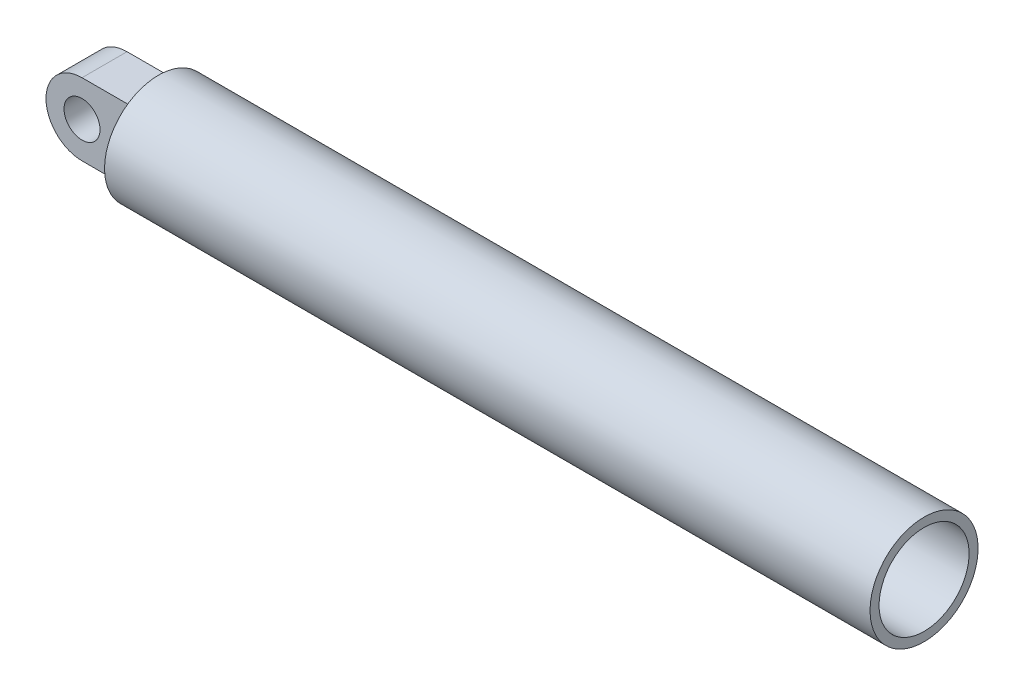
ISO-10303-21;
HEADER;
FILE_DESCRIPTION(('STEP AP214'),'2;1');
FILE_NAME('part.step','',(''),(''),'','','');
FILE_SCHEMA(('AUTOMOTIVE_DESIGN { 1 0 10303 214 1 1 1 1 }'));
ENDSEC;
DATA;
#1=APPLICATION_CONTEXT('core data for automotive mechanical design processes');
#2=APPLICATION_PROTOCOL_DEFINITION('international standard','automotive_design',2000,#1);
#3=PRODUCT_CONTEXT('',#1,'mechanical');
#4=PRODUCT('Part','Part','',(#3));
#5=PRODUCT_RELATED_PRODUCT_CATEGORY('part','',(#4));
#6=PRODUCT_DEFINITION_FORMATION('','',#4);
#7=PRODUCT_DEFINITION_CONTEXT('part definition',#1,'design');
#8=PRODUCT_DEFINITION('design','',#6,#7);
#9=PRODUCT_DEFINITION_SHAPE('','',#8);
#10=(LENGTH_UNIT() NAMED_UNIT(*) SI_UNIT(.MILLI.,.METRE.));
#11=(NAMED_UNIT(*) PLANE_ANGLE_UNIT() SI_UNIT($,.RADIAN.));
#12=(NAMED_UNIT(*) SI_UNIT($,.STERADIAN.) SOLID_ANGLE_UNIT());
#13=UNCERTAINTY_MEASURE_WITH_UNIT(LENGTH_MEASURE(1.E-05),#10,'distance_accuracy_value','');
#14=(GEOMETRIC_REPRESENTATION_CONTEXT(3) GLOBAL_UNCERTAINTY_ASSIGNED_CONTEXT((#13)) GLOBAL_UNIT_ASSIGNED_CONTEXT((#10,
#11,#12)) REPRESENTATION_CONTEXT('',''));
#15=CARTESIAN_POINT('',(0.,0.,0.));
#16=DIRECTION('',(0.,0.,1.));
#17=DIRECTION('',(1.,0.,0.));
#18=AXIS2_PLACEMENT_3D('',#15,#16,#17);
#19=CARTESIAN_POINT('',(0.,0.,0.));
#20=DIRECTION('',(-1.,0.,0.));
#21=DIRECTION('',(0.,0.,1.));
#22=AXIS2_PLACEMENT_3D('',#19,#20,#21);
#23=PLANE('',#22);
#24=CARTESIAN_POINT('',(0.,0.,0.));
#25=DIRECTION('',(-1.,0.,0.));
#26=DIRECTION('',(0.,0.,1.));
#27=AXIS2_PLACEMENT_3D('',#24,#25,#26);
#28=CIRCLE('',#27,60.);
#29=CARTESIAN_POINT('',(0.,0.,60.));
#30=VERTEX_POINT('',#29);
#31=EDGE_CURVE('E94',#30,#30,#28,.T.);
#32=ORIENTED_EDGE('',*,*,#31,.T.);
#33=EDGE_LOOP('',(#32));
#34=FACE_BOUND('',#33,.T.);
#35=DIRECTION('',(0.,1.,0.));
#36=VECTOR('',#35,1.);
#37=CARTESIAN_POINT('',(0.,-40.,25.));
#38=LINE('',#37,#36);
#39=CARTESIAN_POINT('',(0.,-40.,25.));
#40=VERTEX_POINT('',#39);
#41=CARTESIAN_POINT('',(0.,40.,25.));
#42=VERTEX_POINT('',#41);
#43=EDGE_CURVE('E49',#40,#42,#38,.T.);
#44=ORIENTED_EDGE('',*,*,#43,.F.);
#45=DIRECTION('',(0.,0.,-1.));
#46=VECTOR('',#45,1.);
#47=CARTESIAN_POINT('',(0.,-40.,25.));
#48=LINE('',#47,#46);
#49=CARTESIAN_POINT('',(0.,-40.,-25.));
#50=VERTEX_POINT('',#49);
#51=EDGE_CURVE('E54',#40,#50,#48,.T.);
#52=ORIENTED_EDGE('',*,*,#51,.T.);
#53=DIRECTION('',(0.,1.,0.));
#54=VECTOR('',#53,1.);
#55=CARTESIAN_POINT('',(0.,-40.,-25.));
#56=LINE('',#55,#54);
#57=CARTESIAN_POINT('',(0.,40.,-25.));
#58=VERTEX_POINT('',#57);
#59=EDGE_CURVE('E228',#50,#58,#56,.T.);
#60=ORIENTED_EDGE('',*,*,#59,.T.);
#61=DIRECTION('',(0.,0.,-1.));
#62=VECTOR('',#61,1.);
#63=CARTESIAN_POINT('',(0.,40.,25.));
#64=LINE('',#63,#62);
#65=EDGE_CURVE('E99',#42,#58,#64,.T.);
#66=ORIENTED_EDGE('',*,*,#65,.F.);
#67=EDGE_LOOP('',(#44,#52,#60,#66));
#68=FACE_BOUND('',#67,.T.);
#69=ADVANCED_FACE('F34',(#34,#68),#23,.T.);
#70=CARTESIAN_POINT('',(25.,0.,0.));
#71=DIRECTION('',(-1.,0.,0.));
#72=DIRECTION('',(0.,0.,1.));
#73=AXIS2_PLACEMENT_3D('',#70,#71,#72);
#74=PLANE('',#73);
#75=CARTESIAN_POINT('',(25.,0.,0.));
#76=DIRECTION('',(-1.,0.,0.));
#77=DIRECTION('',(0.,0.,1.));
#78=AXIS2_PLACEMENT_3D('',#75,#76,#77);
#79=CIRCLE('',#78,50.0000000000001);
#80=CARTESIAN_POINT('',(25.,0.,50.0000000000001));
#81=VERTEX_POINT('',#80);
#82=EDGE_CURVE('E11',#81,#81,#79,.T.);
#83=ORIENTED_EDGE('',*,*,#82,.F.);
#84=EDGE_LOOP('',(#83));
#85=FACE_BOUND('',#84,.T.);
#86=ADVANCED_FACE('F36',(#85),#74,.F.);
#87=CARTESIAN_POINT('',(0.,0.,0.));
#88=DIRECTION('',(-1.,0.,0.));
#89=DIRECTION('',(0.,0.,1.));
#90=AXIS2_PLACEMENT_3D('',#87,#88,#89);
#91=CYLINDRICAL_SURFACE('',#90,50.);
#92=ORIENTED_EDGE('',*,*,#82,.T.);
#93=EDGE_LOOP('',(#92));
#94=FACE_BOUND('',#93,.T.);
#95=CARTESIAN_POINT('',(850.,0.,0.));
#96=DIRECTION('',(-1.,0.,0.));
#97=DIRECTION('',(0.,0.,1.));
#98=AXIS2_PLACEMENT_3D('',#95,#96,#97);
#99=CIRCLE('',#98,50.);
#100=CARTESIAN_POINT('',(850.,0.,50.));
#101=VERTEX_POINT('',#100);
#102=EDGE_CURVE('E42',#101,#101,#99,.T.);
#103=ORIENTED_EDGE('',*,*,#102,.F.);
#104=EDGE_LOOP('',(#103));
#105=FACE_BOUND('',#104,.T.);
#106=ADVANCED_FACE('F110',(#94,#105),#91,.F.);
#107=CARTESIAN_POINT('',(850.,60.,0.));
#108=DIRECTION('',(1.,0.,0.));
#109=DIRECTION('',(0.,0.,-1.));
#110=AXIS2_PLACEMENT_3D('',#107,#108,#109);
#111=PLANE('',#110);
#112=ORIENTED_EDGE('',*,*,#102,.T.);
#113=EDGE_LOOP('',(#112));
#114=FACE_BOUND('',#113,.T.);
#115=CARTESIAN_POINT('',(850.,0.,0.));
#116=DIRECTION('',(-1.,0.,0.));
#117=DIRECTION('',(0.,0.,1.));
#118=AXIS2_PLACEMENT_3D('',#115,#116,#117);
#119=CIRCLE('',#118,60.);
#120=CARTESIAN_POINT('',(850.,0.,60.));
#121=VERTEX_POINT('',#120);
#122=EDGE_CURVE('E97',#121,#121,#119,.T.);
#123=ORIENTED_EDGE('',*,*,#122,.F.);
#124=EDGE_LOOP('',(#123));
#125=FACE_BOUND('',#124,.T.);
#126=ADVANCED_FACE('F107',(#114,#125),#111,.T.);
#127=CARTESIAN_POINT('',(0.,0.,0.));
#128=DIRECTION('',(-1.,0.,0.));
#129=DIRECTION('',(0.,0.,1.));
#130=AXIS2_PLACEMENT_3D('',#127,#128,#129);
#131=CYLINDRICAL_SURFACE('',#130,60.);
#132=ORIENTED_EDGE('',*,*,#122,.T.);
#133=EDGE_LOOP('',(#132));
#134=FACE_BOUND('',#133,.T.);
#135=ORIENTED_EDGE('',*,*,#31,.F.);
#136=EDGE_LOOP('',(#135));
#137=FACE_BOUND('',#136,.T.);
#138=ADVANCED_FACE('F117',(#134,#137),#131,.T.);
#139=CARTESIAN_POINT('',(-60.,0.,25.));
#140=DIRECTION('',(0.,0.,1.));
#141=DIRECTION('',(1.,0.,0.));
#142=AXIS2_PLACEMENT_3D('',#139,#140,#141);
#143=PLANE('',#142);
#144=CARTESIAN_POINT('',(-60.,0.,25.));
#145=DIRECTION('',(0.,0.,1.));
#146=DIRECTION('',(1.,0.,0.));
#147=AXIS2_PLACEMENT_3D('',#144,#145,#146);
#148=CIRCLE('',#147,40.);
#149=CARTESIAN_POINT('',(-60.,40.,25.));
#150=VERTEX_POINT('',#149);
#151=CARTESIAN_POINT('',(-60.,-40.,25.));
#152=VERTEX_POINT('',#151);
#153=EDGE_CURVE('E80',#150,#152,#148,.T.);
#154=ORIENTED_EDGE('',*,*,#153,.T.);
#155=DIRECTION('',(1.,0.,0.));
#156=VECTOR('',#155,1.);
#157=CARTESIAN_POINT('',(-60.,-40.,25.));
#158=LINE('',#157,#156);
#159=EDGE_CURVE('E73',#152,#40,#158,.T.);
#160=ORIENTED_EDGE('',*,*,#159,.T.);
#161=ORIENTED_EDGE('',*,*,#43,.T.);
#162=DIRECTION('',(1.,0.,0.));
#163=VECTOR('',#162,1.);
#164=CARTESIAN_POINT('',(-60.,40.,25.));
#165=LINE('',#164,#163);
#166=EDGE_CURVE('E87',#150,#42,#165,.T.);
#167=ORIENTED_EDGE('',*,*,#166,.F.);
#168=EDGE_LOOP('',(#154,#160,#161,#167));
#169=FACE_BOUND('',#168,.T.);
#170=CARTESIAN_POINT('',(-60.,0.,25.));
#171=DIRECTION('',(0.,0.,1.));
#172=DIRECTION('',(1.,0.,0.));
#173=AXIS2_PLACEMENT_3D('',#170,#171,#172);
#174=CIRCLE('',#173,20.);
#175=CARTESIAN_POINT('',(-40.,0.,25.));
#176=VERTEX_POINT('',#175);
#177=EDGE_CURVE('E214',#176,#176,#174,.T.);
#178=ORIENTED_EDGE('',*,*,#177,.F.);
#179=EDGE_LOOP('',(#178));
#180=FACE_BOUND('',#179,.T.);
#181=ADVANCED_FACE('F84',(#169,#180),#143,.T.);
#182=CARTESIAN_POINT('',(-60.,0.,-25.));
#183=DIRECTION('',(0.,0.,1.));
#184=DIRECTION('',(1.,0.,0.));
#185=AXIS2_PLACEMENT_3D('',#182,#183,#184);
#186=PLANE('',#185);
#187=CARTESIAN_POINT('',(-60.,0.,-25.));
#188=DIRECTION('',(0.,0.,1.));
#189=DIRECTION('',(1.,0.,0.));
#190=AXIS2_PLACEMENT_3D('',#187,#188,#189);
#191=CIRCLE('',#190,40.);
#192=CARTESIAN_POINT('',(-60.,40.,-25.));
#193=VERTEX_POINT('',#192);
#194=CARTESIAN_POINT('',(-60.,-40.,-25.));
#195=VERTEX_POINT('',#194);
#196=EDGE_CURVE('E93',#193,#195,#191,.T.);
#197=ORIENTED_EDGE('',*,*,#196,.F.);
#198=DIRECTION('',(1.,0.,0.));
#199=VECTOR('',#198,1.);
#200=CARTESIAN_POINT('',(-60.,40.,-25.));
#201=LINE('',#200,#199);
#202=EDGE_CURVE('E89',#193,#58,#201,.T.);
#203=ORIENTED_EDGE('',*,*,#202,.T.);
#204=ORIENTED_EDGE('',*,*,#59,.F.);
#205=DIRECTION('',(1.,0.,0.));
#206=VECTOR('',#205,1.);
#207=CARTESIAN_POINT('',(-60.,-40.,-25.));
#208=LINE('',#207,#206);
#209=EDGE_CURVE('E226',#195,#50,#208,.T.);
#210=ORIENTED_EDGE('',*,*,#209,.F.);
#211=EDGE_LOOP('',(#197,#203,#204,#210));
#212=FACE_BOUND('',#211,.T.);
#213=CARTESIAN_POINT('',(-60.,0.,-25.));
#214=DIRECTION('',(0.,0.,1.));
#215=DIRECTION('',(1.,0.,0.));
#216=AXIS2_PLACEMENT_3D('',#213,#214,#215);
#217=CIRCLE('',#216,20.);
#218=CARTESIAN_POINT('',(-40.,0.,-25.));
#219=VERTEX_POINT('',#218);
#220=EDGE_CURVE('E217',#219,#219,#217,.T.);
#221=ORIENTED_EDGE('',*,*,#220,.T.);
#222=EDGE_LOOP('',(#221));
#223=FACE_BOUND('',#222,.T.);
#224=ADVANCED_FACE('F133',(#212,#223),#186,.F.);
#225=CARTESIAN_POINT('',(-60.,0.,25.));
#226=DIRECTION('',(0.,0.,-1.));
#227=DIRECTION('',(-1.,0.,0.));
#228=AXIS2_PLACEMENT_3D('',#225,#226,#227);
#229=CYLINDRICAL_SURFACE('',#228,40.);
#230=ORIENTED_EDGE('',*,*,#196,.T.);
#231=DIRECTION('',(0.,0.,-1.));
#232=VECTOR('',#231,1.);
#233=CARTESIAN_POINT('',(-60.,-40.,25.));
#234=LINE('',#233,#232);
#235=EDGE_CURVE('E77',#152,#195,#234,.T.);
#236=ORIENTED_EDGE('',*,*,#235,.F.);
#237=ORIENTED_EDGE('',*,*,#153,.F.);
#238=DIRECTION('',(0.,0.,-1.));
#239=VECTOR('',#238,1.);
#240=CARTESIAN_POINT('',(-60.,40.,25.));
#241=LINE('',#240,#239);
#242=EDGE_CURVE('E224',#150,#193,#241,.T.);
#243=ORIENTED_EDGE('',*,*,#242,.T.);
#244=EDGE_LOOP('',(#230,#236,#237,#243));
#245=FACE_BOUND('',#244,.T.);
#246=ADVANCED_FACE('F91',(#245),#229,.T.);
#247=CARTESIAN_POINT('',(-60.,-40.,25.));
#248=DIRECTION('',(0.,1.,0.));
#249=DIRECTION('',(-1.,0.,0.));
#250=AXIS2_PLACEMENT_3D('',#247,#248,#249);
#251=PLANE('',#250);
#252=ORIENTED_EDGE('',*,*,#209,.T.);
#253=ORIENTED_EDGE('',*,*,#51,.F.);
#254=ORIENTED_EDGE('',*,*,#159,.F.);
#255=ORIENTED_EDGE('',*,*,#235,.T.);
#256=EDGE_LOOP('',(#252,#253,#254,#255));
#257=FACE_BOUND('',#256,.T.);
#258=ADVANCED_FACE('F75',(#257),#251,.F.);
#259=CARTESIAN_POINT('',(-60.,40.,25.));
#260=DIRECTION('',(0.,1.,0.));
#261=DIRECTION('',(-1.,0.,0.));
#262=AXIS2_PLACEMENT_3D('',#259,#260,#261);
#263=PLANE('',#262);
#264=ORIENTED_EDGE('',*,*,#202,.F.);
#265=ORIENTED_EDGE('',*,*,#242,.F.);
#266=ORIENTED_EDGE('',*,*,#166,.T.);
#267=ORIENTED_EDGE('',*,*,#65,.T.);
#268=EDGE_LOOP('',(#264,#265,#266,#267));
#269=FACE_BOUND('',#268,.T.);
#270=ADVANCED_FACE('F146',(#269),#263,.T.);
#271=CARTESIAN_POINT('',(-60.,0.,25.));
#272=DIRECTION('',(0.,0.,-1.));
#273=DIRECTION('',(-1.,0.,0.));
#274=AXIS2_PLACEMENT_3D('',#271,#272,#273);
#275=CYLINDRICAL_SURFACE('',#274,20.);
#276=ORIENTED_EDGE('',*,*,#177,.T.);
#277=EDGE_LOOP('',(#276));
#278=FACE_BOUND('',#277,.T.);
#279=ORIENTED_EDGE('',*,*,#220,.F.);
#280=EDGE_LOOP('',(#279));
#281=FACE_BOUND('',#280,.T.);
#282=ADVANCED_FACE('F144',(#278,#281),#275,.F.);
#283=CLOSED_SHELL('',(#69,#86,#106,#126,#138,#181,#224,#246,#258,#270,#282));
#284=MANIFOLD_SOLID_BREP('B2',#283);
#285=ADVANCED_BREP_SHAPE_REPRESENTATION('',(#18,#284),#14);
#286=SHAPE_DEFINITION_REPRESENTATION(#9,#285);
ENDSEC;
END-ISO-10303-21;
